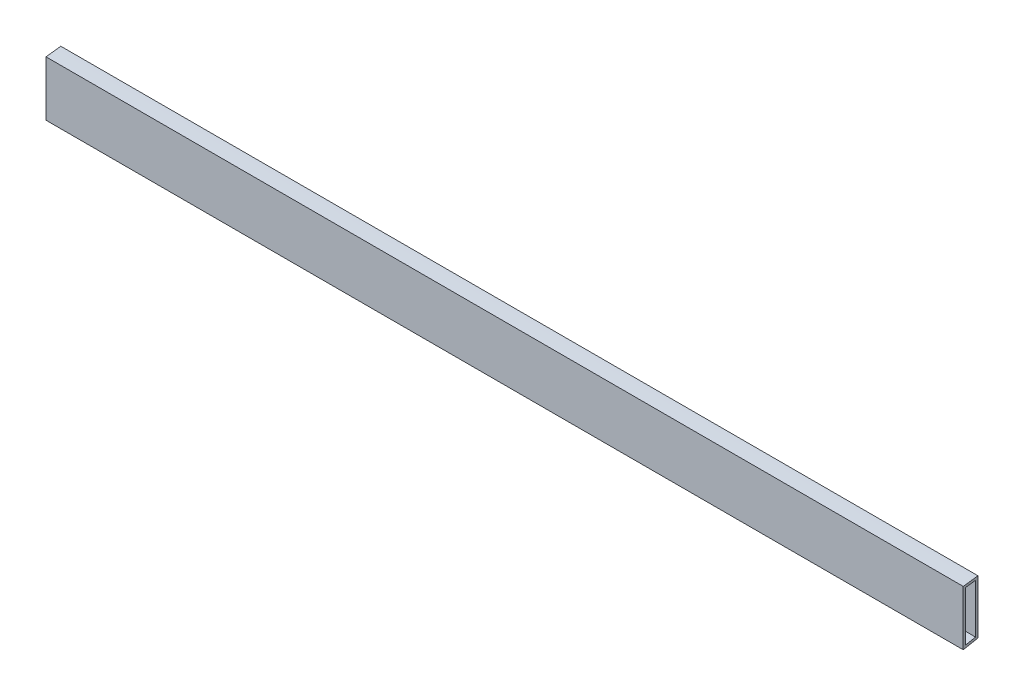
ISO-10303-21;
HEADER;
FILE_DESCRIPTION(('STEP AP214'),'2;1');
FILE_NAME('part.step','',(''),(''),'','','');
FILE_SCHEMA(('AUTOMOTIVE_DESIGN { 1 0 10303 214 1 1 1 1 }'));
ENDSEC;
DATA;
#1=APPLICATION_CONTEXT('core data for automotive mechanical design processes');
#2=APPLICATION_PROTOCOL_DEFINITION('international standard','automotive_design',2000,#1);
#3=PRODUCT_CONTEXT('',#1,'mechanical');
#4=PRODUCT('Part','Part','',(#3));
#5=PRODUCT_RELATED_PRODUCT_CATEGORY('part','',(#4));
#6=PRODUCT_DEFINITION_FORMATION('','',#4);
#7=PRODUCT_DEFINITION_CONTEXT('part definition',#1,'design');
#8=PRODUCT_DEFINITION('design','',#6,#7);
#9=PRODUCT_DEFINITION_SHAPE('','',#8);
#10=(LENGTH_UNIT() NAMED_UNIT(*) SI_UNIT(.MILLI.,.METRE.));
#11=(NAMED_UNIT(*) PLANE_ANGLE_UNIT() SI_UNIT($,.RADIAN.));
#12=(NAMED_UNIT(*) SI_UNIT($,.STERADIAN.) SOLID_ANGLE_UNIT());
#13=UNCERTAINTY_MEASURE_WITH_UNIT(LENGTH_MEASURE(1.E-05),#10,'distance_accuracy_value','');
#14=(GEOMETRIC_REPRESENTATION_CONTEXT(3) GLOBAL_UNCERTAINTY_ASSIGNED_CONTEXT((#13)) GLOBAL_UNIT_ASSIGNED_CONTEXT((#10,
#11,#12)) REPRESENTATION_CONTEXT('',''));
#15=CARTESIAN_POINT('',(0.,0.,0.));
#16=DIRECTION('',(0.,0.,1.));
#17=DIRECTION('',(1.,0.,0.));
#18=AXIS2_PLACEMENT_3D('',#15,#16,#17);
#19=CARTESIAN_POINT('',(295.275,19.2330425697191,-34.1267813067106));
#20=DIRECTION('',(-1.,0.,0.));
#21=DIRECTION('',(0.,0.,1.));
#22=AXIS2_PLACEMENT_3D('',#19,#20,#21);
#23=PLANE('',#22);
#24=CARTESIAN_POINT('',(295.275,19.4825082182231,-36.5125));
#25=CARTESIAN_POINT('',(295.275,19.3766981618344,-35.3153323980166));
#26=CARTESIAN_POINT('',(295.275,19.1970987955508,-33.7257577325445));
#27=CARTESIAN_POINT('',(295.275,18.9685774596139,-32.1428293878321));
#28=CARTESIAN_POINT('',(295.275,18.9086575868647,-31.75));
#29=B_SPLINE_CURVE_WITH_KNOTS('',3,(#24,#25,#26,#27,#28),.UNSPECIFIED.,.F.,.F.,(4,1,4),
(0.36783234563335,0.379615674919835,0.383511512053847),.UNSPECIFIED.);
#30=CARTESIAN_POINT('',(295.275,19.482508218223,-36.5125));
#31=VERTEX_POINT('',#30);
#32=CARTESIAN_POINT('',(295.275,18.9086575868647,-31.75));
#33=VERTEX_POINT('',#32);
#34=EDGE_CURVE('E192',#31,#33,#29,.T.);
#35=ORIENTED_EDGE('',*,*,#34,.T.);
#36=DIRECTION('',(0.,-1.,0.));
#37=VECTOR('',#36,1.);
#38=CARTESIAN_POINT('',(295.275,18.9086575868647,-31.75));
#39=LINE('',#38,#37);
#40=CARTESIAN_POINT('',(295.275,1.2273317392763,-31.75));
#41=VERTEX_POINT('',#40);
#42=EDGE_CURVE('E168',#33,#41,#39,.T.);
#43=ORIENTED_EDGE('',*,*,#42,.T.);
#44=CARTESIAN_POINT('',(295.275,1.2273317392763,-31.75));
#45=CARTESIAN_POINT('',(295.275,1.4220821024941,-32.7735827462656));
#46=CARTESIAN_POINT('',(295.275,1.72348122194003,-34.3608735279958));
#47=CARTESIAN_POINT('',(295.275,2.02251846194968,-35.9486183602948));
#48=CARTESIAN_POINT('',(295.275,2.12827332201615,-36.5125));
#49=B_SPLINE_CURVE_WITH_KNOTS('',3,(#44,#45,#46,#47,#48),.UNSPECIFIED.,.F.,.F.,(4,1,4),
(0.620226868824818,0.630443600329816,0.636069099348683),.UNSPECIFIED.);
#50=CARTESIAN_POINT('',(295.275,2.12827332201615,-36.5125));
#51=VERTEX_POINT('',#50);
#52=EDGE_CURVE('E161',#41,#51,#49,.T.);
#53=ORIENTED_EDGE('',*,*,#52,.T.);
#54=DIRECTION('',(0.,1.,0.));
#55=VECTOR('',#54,1.);
#56=CARTESIAN_POINT('',(295.275,19.482508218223,-36.5125));
#57=LINE('',#56,#55);
#58=EDGE_CURVE('E167',#51,#31,#57,.T.);
#59=ORIENTED_EDGE('',*,*,#58,.T.);
#60=EDGE_LOOP('',(#35,#43,#53,#59));
#61=FACE_BOUND('',#60,.T.);
#62=CARTESIAN_POINT('',(295.275,18.6103708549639,-35.71875));
#63=CARTESIAN_POINT('',(295.275,18.5040045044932,-34.6579138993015));
#64=CARTESIAN_POINT('',(295.275,18.374784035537,-33.5991378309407));
#65=CARTESIAN_POINT('',(295.275,18.2236431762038,-32.54375));
#66=B_SPLINE_CURVE_WITH_KNOTS('',3,(#62,#63,#64,#65),.UNSPECIFIED.,.F.,.F.,(4,4),
(0.370697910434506,0.381261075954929),.UNSPECIFIED.);
#67=CARTESIAN_POINT('',(295.275,18.6103708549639,-35.71875));
#68=VERTEX_POINT('',#67);
#69=CARTESIAN_POINT('',(295.275,18.2236431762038,-32.54375));
#70=VERTEX_POINT('',#69);
#71=EDGE_CURVE('E99',#68,#70,#66,.T.);
#72=ORIENTED_EDGE('',*,*,#71,.F.);
#73=DIRECTION('',(0.,1.,0.));
#74=VECTOR('',#73,1.);
#75=CARTESIAN_POINT('',(295.275,18.6103708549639,-35.71875));
#76=LINE('',#75,#74);
#77=CARTESIAN_POINT('',(295.275,2.78680767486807,-35.71875));
#78=VERTEX_POINT('',#77);
#79=EDGE_CURVE('E121',#78,#68,#76,.T.);
#80=ORIENTED_EDGE('',*,*,#79,.F.);
#81=CARTESIAN_POINT('',(295.275,2.18621440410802,-32.5437500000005));
#82=CARTESIAN_POINT('',(295.275,2.3872384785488,-33.6019266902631));
#83=CARTESIAN_POINT('',(295.275,2.58767763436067,-34.6602152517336));
#84=CARTESIAN_POINT('',(295.275,2.78680767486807,-35.71875));
#85=B_SPLINE_CURVE_WITH_KNOTS('',3,(#81,#82,#83,#84),.UNSPECIFIED.,.F.,.F.,(4,4),
(0.623360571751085,0.633917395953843),.UNSPECIFIED.);
#86=CARTESIAN_POINT('',(295.275,2.18621440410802,-32.5437500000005));
#87=VERTEX_POINT('',#86);
#88=EDGE_CURVE('E119',#87,#78,#85,.T.);
#89=ORIENTED_EDGE('',*,*,#88,.F.);
#90=DIRECTION('',(0.,-1.,0.));
#91=VECTOR('',#90,1.);
#92=CARTESIAN_POINT('',(295.275,18.2236431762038,-32.54375));
#93=LINE('',#92,#91);
#94=EDGE_CURVE('E107',#70,#87,#93,.T.);
#95=ORIENTED_EDGE('',*,*,#94,.F.);
#96=EDGE_LOOP('',(#72,#80,#89,#95));
#97=FACE_BOUND('',#96,.T.);
#98=ADVANCED_FACE('F33',(#61,#97),#23,.F.);
#99=CARTESIAN_POINT('',(0.,19.2330425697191,-34.1267813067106));
#100=DIRECTION('',(-1.,0.,0.));
#101=DIRECTION('',(0.,0.,1.));
#102=AXIS2_PLACEMENT_3D('',#99,#100,#101);
#103=PLANE('',#102);
#104=CARTESIAN_POINT('',(0.,19.4825082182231,-36.5125));
#105=CARTESIAN_POINT('',(0.,19.3766981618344,-35.3153323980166));
#106=CARTESIAN_POINT('',(0.,19.1970987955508,-33.7257577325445));
#107=CARTESIAN_POINT('',(0.,18.9685774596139,-32.1428293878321));
#108=CARTESIAN_POINT('',(0.,18.9086575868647,-31.75));
#109=B_SPLINE_CURVE_WITH_KNOTS('',3,(#104,#105,#106,#107,#108),.UNSPECIFIED.,.F.,.F.,(4,1,4),
(0.36783234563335,0.379615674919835,0.383511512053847),.UNSPECIFIED.);
#110=CARTESIAN_POINT('',(0.,19.482508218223,-36.5125));
#111=VERTEX_POINT('',#110);
#112=CARTESIAN_POINT('',(0.,18.9086575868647,-31.75));
#113=VERTEX_POINT('',#112);
#114=EDGE_CURVE('E115',#111,#113,#109,.T.);
#115=ORIENTED_EDGE('',*,*,#114,.F.);
#116=DIRECTION('',(0.,1.,0.));
#117=VECTOR('',#116,1.);
#118=CARTESIAN_POINT('',(0.,19.482508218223,-36.5125));
#119=LINE('',#118,#117);
#120=CARTESIAN_POINT('',(0.,2.12827332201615,-36.5125));
#121=VERTEX_POINT('',#120);
#122=EDGE_CURVE('E187',#121,#111,#119,.T.);
#123=ORIENTED_EDGE('',*,*,#122,.F.);
#124=CARTESIAN_POINT('',(0.,1.2273317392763,-31.75));
#125=CARTESIAN_POINT('',(0.,1.4220821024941,-32.7735827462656));
#126=CARTESIAN_POINT('',(0.,1.72348122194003,-34.3608735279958));
#127=CARTESIAN_POINT('',(0.,2.02251846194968,-35.9486183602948));
#128=CARTESIAN_POINT('',(0.,2.12827332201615,-36.5125));
#129=B_SPLINE_CURVE_WITH_KNOTS('',3,(#124,#125,#126,#127,#128),.UNSPECIFIED.,.F.,.F.,(4,1,4),
(0.620226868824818,0.630443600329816,0.636069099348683),.UNSPECIFIED.);
#130=CARTESIAN_POINT('',(0.,1.2273317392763,-31.75));
#131=VERTEX_POINT('',#130);
#132=EDGE_CURVE('E183',#131,#121,#129,.T.);
#133=ORIENTED_EDGE('',*,*,#132,.F.);
#134=DIRECTION('',(0.,-1.,0.));
#135=VECTOR('',#134,1.);
#136=CARTESIAN_POINT('',(0.,18.9086575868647,-31.75));
#137=LINE('',#136,#135);
#138=EDGE_CURVE('E178',#113,#131,#137,.T.);
#139=ORIENTED_EDGE('',*,*,#138,.F.);
#140=EDGE_LOOP('',(#115,#123,#133,#139));
#141=FACE_BOUND('',#140,.T.);
#142=DIRECTION('',(0.,1.,0.));
#143=VECTOR('',#142,1.);
#144=CARTESIAN_POINT('',(0.,18.6103708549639,-35.71875));
#145=LINE('',#144,#143);
#146=CARTESIAN_POINT('',(0.,2.78680767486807,-35.71875));
#147=VERTEX_POINT('',#146);
#148=CARTESIAN_POINT('',(0.,18.6103708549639,-35.71875));
#149=VERTEX_POINT('',#148);
#150=EDGE_CURVE('E108',#147,#149,#145,.T.);
#151=ORIENTED_EDGE('',*,*,#150,.T.);
#152=CARTESIAN_POINT('',(0.,18.6103708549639,-35.71875));
#153=CARTESIAN_POINT('',(0.,18.5040045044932,-34.6579138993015));
#154=CARTESIAN_POINT('',(0.,18.374784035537,-33.5991378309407));
#155=CARTESIAN_POINT('',(0.,18.2236431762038,-32.54375));
#156=B_SPLINE_CURVE_WITH_KNOTS('',3,(#152,#153,#154,#155),.UNSPECIFIED.,.F.,.F.,(4,4),
(0.370697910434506,0.381261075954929),.UNSPECIFIED.);
#157=CARTESIAN_POINT('',(0.,18.2236431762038,-32.54375));
#158=VERTEX_POINT('',#157);
#159=EDGE_CURVE('E57',#149,#158,#156,.T.);
#160=ORIENTED_EDGE('',*,*,#159,.T.);
#161=DIRECTION('',(0.,-1.,0.));
#162=VECTOR('',#161,1.);
#163=CARTESIAN_POINT('',(0.,18.2236431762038,-32.54375));
#164=LINE('',#163,#162);
#165=CARTESIAN_POINT('',(0.,2.18621440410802,-32.5437500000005));
#166=VERTEX_POINT('',#165);
#167=EDGE_CURVE('E114',#158,#166,#164,.T.);
#168=ORIENTED_EDGE('',*,*,#167,.T.);
#169=CARTESIAN_POINT('',(0.,2.18621440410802,-32.5437500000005));
#170=CARTESIAN_POINT('',(0.,2.3872384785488,-33.6019266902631));
#171=CARTESIAN_POINT('',(0.,2.58767763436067,-34.6602152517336));
#172=CARTESIAN_POINT('',(0.,2.78680767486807,-35.71875));
#173=B_SPLINE_CURVE_WITH_KNOTS('',3,(#169,#170,#171,#172),.UNSPECIFIED.,.F.,.F.,(4,4),
(0.623360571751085,0.633917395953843),.UNSPECIFIED.);
#174=EDGE_CURVE('E224',#166,#147,#173,.T.);
#175=ORIENTED_EDGE('',*,*,#174,.T.);
#176=EDGE_LOOP('',(#151,#160,#168,#175));
#177=FACE_BOUND('',#176,.T.);
#178=ADVANCED_FACE('F148',(#141,#177),#103,.T.);
#179=DIRECTION('',(-1.,0.,0.));
#180=VECTOR('',#179,1.);
#181=SURFACE_OF_LINEAR_EXTRUSION('',#29,#180);
#182=ORIENTED_EDGE('',*,*,#114,.T.);
#183=DIRECTION('',(-1.,0.,0.));
#184=VECTOR('',#183,1.);
#185=CARTESIAN_POINT('',(295.275,18.9086575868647,-31.75));
#186=LINE('',#185,#184);
#187=EDGE_CURVE('E11',#33,#113,#186,.T.);
#188=ORIENTED_EDGE('',*,*,#187,.F.);
#189=ORIENTED_EDGE('',*,*,#34,.F.);
#190=DIRECTION('',(-1.,0.,0.));
#191=VECTOR('',#190,1.);
#192=CARTESIAN_POINT('',(295.275,19.482508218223,-36.5125));
#193=LINE('',#192,#191);
#194=EDGE_CURVE('E173',#31,#111,#193,.T.);
#195=ORIENTED_EDGE('',*,*,#194,.T.);
#196=EDGE_LOOP('',(#182,#188,#189,#195));
#197=FACE_BOUND('',#196,.T.);
#198=ADVANCED_FACE('F35',(#197),#181,.F.);
#199=CARTESIAN_POINT('',(295.275,18.9086575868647,-31.75));
#200=DIRECTION('',(0.,0.,-1.));
#201=DIRECTION('',(0.,1.,0.));
#202=AXIS2_PLACEMENT_3D('',#199,#200,#201);
#203=PLANE('',#202);
#204=ORIENTED_EDGE('',*,*,#138,.T.);
#205=DIRECTION('',(-1.,0.,0.));
#206=VECTOR('',#205,1.);
#207=CARTESIAN_POINT('',(295.275,1.2273317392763,-31.75));
#208=LINE('',#207,#206);
#209=EDGE_CURVE('E42',#41,#131,#208,.T.);
#210=ORIENTED_EDGE('',*,*,#209,.F.);
#211=ORIENTED_EDGE('',*,*,#42,.F.);
#212=ORIENTED_EDGE('',*,*,#187,.T.);
#213=EDGE_LOOP('',(#204,#210,#211,#212));
#214=FACE_BOUND('',#213,.T.);
#215=ADVANCED_FACE('F159',(#214),#203,.F.);
#216=DIRECTION('',(-1.,0.,0.));
#217=VECTOR('',#216,1.);
#218=SURFACE_OF_LINEAR_EXTRUSION('',#49,#217);
#219=ORIENTED_EDGE('',*,*,#132,.T.);
#220=DIRECTION('',(-1.,0.,0.));
#221=VECTOR('',#220,1.);
#222=CARTESIAN_POINT('',(295.275,2.12827332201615,-36.5125));
#223=LINE('',#222,#221);
#224=EDGE_CURVE('E195',#51,#121,#223,.T.);
#225=ORIENTED_EDGE('',*,*,#224,.F.);
#226=ORIENTED_EDGE('',*,*,#52,.F.);
#227=ORIENTED_EDGE('',*,*,#209,.T.);
#228=EDGE_LOOP('',(#219,#225,#226,#227));
#229=FACE_BOUND('',#228,.T.);
#230=ADVANCED_FACE('F155',(#229),#218,.F.);
#231=CARTESIAN_POINT('',(295.275,19.482508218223,-36.5125));
#232=DIRECTION('',(0.,0.,1.));
#233=DIRECTION('',(0.,-1.,0.));
#234=AXIS2_PLACEMENT_3D('',#231,#232,#233);
#235=PLANE('',#234);
#236=ORIENTED_EDGE('',*,*,#122,.T.);
#237=ORIENTED_EDGE('',*,*,#194,.F.);
#238=ORIENTED_EDGE('',*,*,#58,.F.);
#239=ORIENTED_EDGE('',*,*,#224,.T.);
#240=EDGE_LOOP('',(#236,#237,#238,#239));
#241=FACE_BOUND('',#240,.T.);
#242=ADVANCED_FACE('F145',(#241),#235,.F.);
#243=DIRECTION('',(-1.,0.,0.));
#244=VECTOR('',#243,1.);
#245=SURFACE_OF_LINEAR_EXTRUSION('',#66,#244);
#246=ORIENTED_EDGE('',*,*,#159,.F.);
#247=DIRECTION('',(-1.,0.,0.));
#248=VECTOR('',#247,1.);
#249=CARTESIAN_POINT('',(295.275,18.6103708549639,-35.71875));
#250=LINE('',#249,#248);
#251=EDGE_CURVE('E103',#68,#149,#250,.T.);
#252=ORIENTED_EDGE('',*,*,#251,.F.);
#253=ORIENTED_EDGE('',*,*,#71,.T.);
#254=DIRECTION('',(-1.,0.,0.));
#255=VECTOR('',#254,1.);
#256=CARTESIAN_POINT('',(295.275,18.2236431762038,-32.54375));
#257=LINE('',#256,#255);
#258=EDGE_CURVE('E102',#70,#158,#257,.T.);
#259=ORIENTED_EDGE('',*,*,#258,.T.);
#260=EDGE_LOOP('',(#246,#252,#253,#259));
#261=FACE_BOUND('',#260,.T.);
#262=ADVANCED_FACE('F101',(#261),#245,.T.);
#263=CARTESIAN_POINT('',(295.275,18.2236431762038,-32.54375));
#264=DIRECTION('',(0.,0.,-1.));
#265=DIRECTION('',(0.,1.,0.));
#266=AXIS2_PLACEMENT_3D('',#263,#264,#265);
#267=PLANE('',#266);
#268=ORIENTED_EDGE('',*,*,#167,.F.);
#269=ORIENTED_EDGE('',*,*,#258,.F.);
#270=ORIENTED_EDGE('',*,*,#94,.T.);
#271=DIRECTION('',(-1.,0.,0.));
#272=VECTOR('',#271,1.);
#273=CARTESIAN_POINT('',(295.275,2.18621440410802,-32.5437500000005));
#274=LINE('',#273,#272);
#275=EDGE_CURVE('E116',#87,#166,#274,.T.);
#276=ORIENTED_EDGE('',*,*,#275,.T.);
#277=EDGE_LOOP('',(#268,#269,#270,#276));
#278=FACE_BOUND('',#277,.T.);
#279=ADVANCED_FACE('F111',(#278),#267,.T.);
#280=DIRECTION('',(-1.,0.,0.));
#281=VECTOR('',#280,1.);
#282=SURFACE_OF_LINEAR_EXTRUSION('',#85,#281);
#283=ORIENTED_EDGE('',*,*,#174,.F.);
#284=ORIENTED_EDGE('',*,*,#275,.F.);
#285=ORIENTED_EDGE('',*,*,#88,.T.);
#286=DIRECTION('',(-1.,0.,0.));
#287=VECTOR('',#286,1.);
#288=CARTESIAN_POINT('',(295.275,2.78680767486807,-35.71875));
#289=LINE('',#288,#287);
#290=EDGE_CURVE('E49',#78,#147,#289,.T.);
#291=ORIENTED_EDGE('',*,*,#290,.T.);
#292=EDGE_LOOP('',(#283,#284,#285,#291));
#293=FACE_BOUND('',#292,.T.);
#294=ADVANCED_FACE('F135',(#293),#282,.T.);
#295=CARTESIAN_POINT('',(295.275,18.6103708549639,-35.71875));
#296=DIRECTION('',(0.,0.,1.));
#297=DIRECTION('',(0.,-1.,0.));
#298=AXIS2_PLACEMENT_3D('',#295,#296,#297);
#299=PLANE('',#298);
#300=ORIENTED_EDGE('',*,*,#150,.F.);
#301=ORIENTED_EDGE('',*,*,#290,.F.);
#302=ORIENTED_EDGE('',*,*,#79,.T.);
#303=ORIENTED_EDGE('',*,*,#251,.T.);
#304=EDGE_LOOP('',(#300,#301,#302,#303));
#305=FACE_BOUND('',#304,.T.);
#306=ADVANCED_FACE('F139',(#305),#299,.T.);
#307=CLOSED_SHELL('',(#98,#178,#198,#215,#230,#242,#262,#279,#294,#306));
#308=MANIFOLD_SOLID_BREP('B2',#307);
#309=ADVANCED_BREP_SHAPE_REPRESENTATION('',(#18,#308),#14);
#310=SHAPE_DEFINITION_REPRESENTATION(#9,#309);
ENDSEC;
END-ISO-10303-21;
